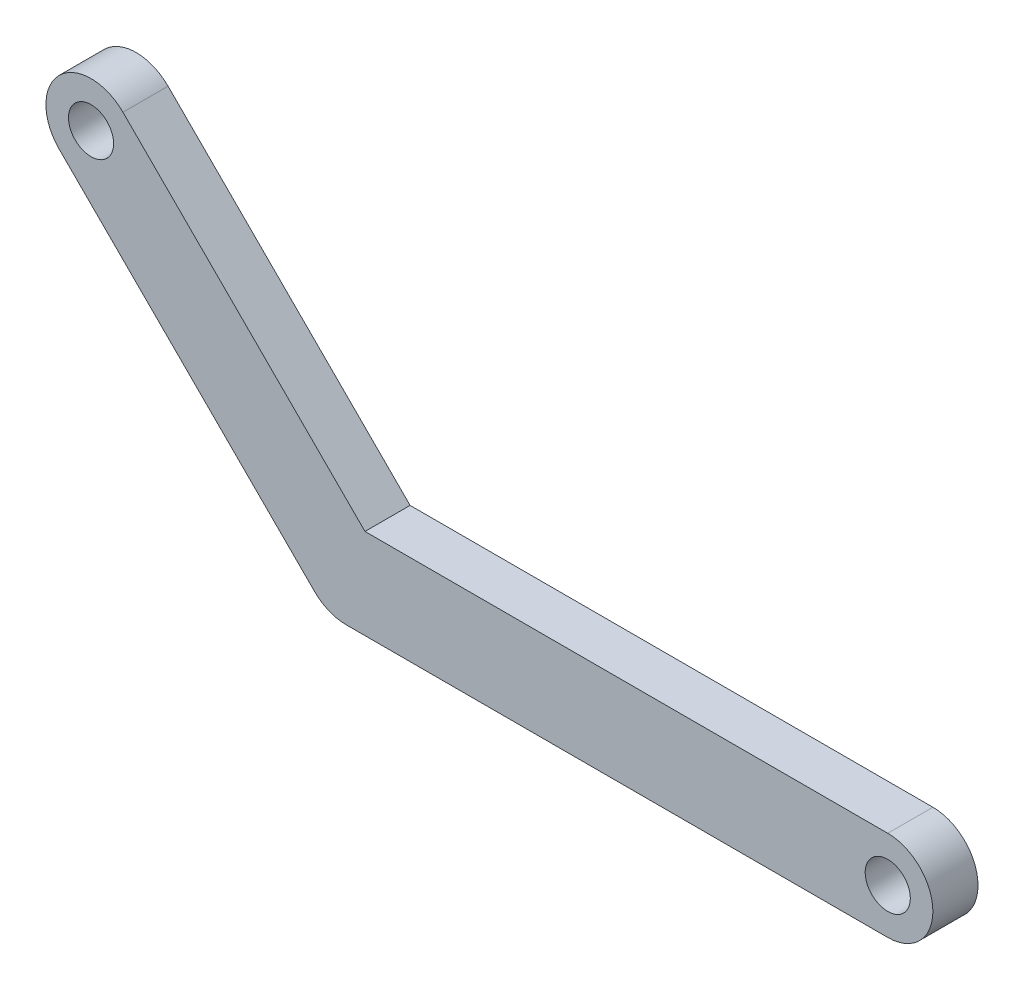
ISO-10303-21;
HEADER;
FILE_DESCRIPTION(('STEP AP214'),'2;1');
FILE_NAME('part.step','',(''),(''),'','','');
FILE_SCHEMA(('AUTOMOTIVE_DESIGN { 1 0 10303 214 1 1 1 1 }'));
ENDSEC;
DATA;
#1=APPLICATION_CONTEXT('core data for automotive mechanical design processes');
#2=APPLICATION_PROTOCOL_DEFINITION('international standard','automotive_design',2000,#1);
#3=PRODUCT_CONTEXT('',#1,'mechanical');
#4=PRODUCT('Part','Part','',(#3));
#5=PRODUCT_RELATED_PRODUCT_CATEGORY('part','',(#4));
#6=PRODUCT_DEFINITION_FORMATION('','',#4);
#7=PRODUCT_DEFINITION_CONTEXT('part definition',#1,'design');
#8=PRODUCT_DEFINITION('design','',#6,#7);
#9=PRODUCT_DEFINITION_SHAPE('','',#8);
#10=(LENGTH_UNIT() NAMED_UNIT(*) SI_UNIT(.MILLI.,.METRE.));
#11=(NAMED_UNIT(*) PLANE_ANGLE_UNIT() SI_UNIT($,.RADIAN.));
#12=(NAMED_UNIT(*) SI_UNIT($,.STERADIAN.) SOLID_ANGLE_UNIT());
#13=UNCERTAINTY_MEASURE_WITH_UNIT(LENGTH_MEASURE(1.E-05),#10,'distance_accuracy_value','');
#14=(GEOMETRIC_REPRESENTATION_CONTEXT(3) GLOBAL_UNCERTAINTY_ASSIGNED_CONTEXT((#13)) GLOBAL_UNIT_ASSIGNED_CONTEXT((#10,
#11,#12)) REPRESENTATION_CONTEXT('',''));
#15=CARTESIAN_POINT('',(0.,0.,0.));
#16=DIRECTION('',(0.,0.,1.));
#17=DIRECTION('',(1.,0.,0.));
#18=AXIS2_PLACEMENT_3D('',#15,#16,#17);
#19=CARTESIAN_POINT('',(0.,3.175,3.175));
#20=DIRECTION('',(0.,-1.,0.));
#21=DIRECTION('',(0.,0.,-1.));
#22=AXIS2_PLACEMENT_3D('',#19,#20,#21);
#23=PLANE('',#22);
#24=DIRECTION('',(0.,0.,-1.));
#25=VECTOR('',#24,1.);
#26=CARTESIAN_POINT('',(1.31512806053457,3.175,3.175));
#27=LINE('',#26,#25);
#28=CARTESIAN_POINT('',(1.31512806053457,3.175,3.175));
#29=VERTEX_POINT('',#28);
#30=CARTESIAN_POINT('',(1.31512806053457,3.175,0.));
#31=VERTEX_POINT('',#30);
#32=EDGE_CURVE('E11',#29,#31,#27,.T.);
#33=ORIENTED_EDGE('',*,*,#32,.F.);
#34=DIRECTION('',(-1.,0.,0.));
#35=VECTOR('',#34,1.);
#36=CARTESIAN_POINT('',(0.,3.175,3.175));
#37=LINE('',#36,#35);
#38=CARTESIAN_POINT('',(38.1,3.175,3.175));
#39=VERTEX_POINT('',#38);
#40=EDGE_CURVE('E98',#39,#29,#37,.T.);
#41=ORIENTED_EDGE('',*,*,#40,.F.);
#42=DIRECTION('',(0.,0.,-1.));
#43=VECTOR('',#42,1.);
#44=CARTESIAN_POINT('',(38.1,3.175,3.175));
#45=LINE('',#44,#43);
#46=CARTESIAN_POINT('',(38.1,3.175,0.));
#47=VERTEX_POINT('',#46);
#48=EDGE_CURVE('E141',#39,#47,#45,.T.);
#49=ORIENTED_EDGE('',*,*,#48,.T.);
#50=DIRECTION('',(-1.,0.,0.));
#51=VECTOR('',#50,1.);
#52=CARTESIAN_POINT('',(0.,3.175,0.));
#53=LINE('',#52,#51);
#54=EDGE_CURVE('E136',#47,#31,#53,.T.);
#55=ORIENTED_EDGE('',*,*,#54,.T.);
#56=EDGE_LOOP('',(#33,#41,#49,#55));
#57=FACE_BOUND('',#56,.T.);
#58=ADVANCED_FACE('F32',(#57),#23,.F.);
#59=CARTESIAN_POINT('',(0.,0.,3.175));
#60=DIRECTION('',(0.,0.,1.));
#61=DIRECTION('',(1.,0.,0.));
#62=AXIS2_PLACEMENT_3D('',#59,#60,#61);
#63=PLANE('',#62);
#64=CARTESIAN_POINT('',(0.,0.,3.175));
#65=DIRECTION('',(0.,0.,1.));
#66=DIRECTION('',(1.,0.,0.));
#67=AXIS2_PLACEMENT_3D('',#64,#65,#66);
#68=CIRCLE('',#67,3.175);
#69=CARTESIAN_POINT('',(-2.24506403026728,-2.2450640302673,3.175));
#70=VERTEX_POINT('',#69);
#71=CARTESIAN_POINT('',(0.,-3.175,3.175));
#72=VERTEX_POINT('',#71);
#73=EDGE_CURVE('E47',#70,#72,#68,.T.);
#74=ORIENTED_EDGE('',*,*,#73,.T.);
#75=DIRECTION('',(1.,0.,0.));
#76=VECTOR('',#75,1.);
#77=CARTESIAN_POINT('',(0.,-3.175,3.175));
#78=LINE('',#77,#76);
#79=CARTESIAN_POINT('',(38.1,-3.175,3.175));
#80=VERTEX_POINT('',#79);
#81=EDGE_CURVE('E135',#72,#80,#78,.T.);
#82=ORIENTED_EDGE('',*,*,#81,.T.);
#83=CARTESIAN_POINT('',(38.1,0.,3.175));
#84=DIRECTION('',(0.,0.,1.));
#85=DIRECTION('',(1.,0.,0.));
#86=AXIS2_PLACEMENT_3D('',#83,#84,#85);
#87=CIRCLE('',#86,3.175);
#88=EDGE_CURVE('E138',#80,#39,#87,.T.);
#89=ORIENTED_EDGE('',*,*,#88,.T.);
#90=ORIENTED_EDGE('',*,*,#40,.T.);
#91=DIRECTION('',(-0.707106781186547,0.707106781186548,0.));
#92=VECTOR('',#91,1.);
#93=CARTESIAN_POINT('',(2.24506403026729,2.24506403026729,3.175));
#94=LINE('',#93,#92);
#95=CARTESIAN_POINT('',(-15.7154482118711,20.2055762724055,3.175));
#96=VERTEX_POINT('',#95);
#97=EDGE_CURVE('E90',#29,#96,#94,.T.);
#98=ORIENTED_EDGE('',*,*,#97,.T.);
#99=CARTESIAN_POINT('',(-17.9605122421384,17.9605122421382,3.175));
#100=DIRECTION('',(0.,0.,1.));
#101=DIRECTION('',(1.,0.,0.));
#102=AXIS2_PLACEMENT_3D('',#99,#100,#101);
#103=CIRCLE('',#102,3.17500000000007);
#104=CARTESIAN_POINT('',(-20.2055762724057,15.7154482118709,3.175));
#105=VERTEX_POINT('',#104);
#106=EDGE_CURVE('E95',#96,#105,#103,.T.);
#107=ORIENTED_EDGE('',*,*,#106,.T.);
#108=DIRECTION('',(0.707106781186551,-0.707106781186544,0.));
#109=VECTOR('',#108,1.);
#110=CARTESIAN_POINT('',(-2.24506403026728,-2.2450640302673,3.175));
#111=LINE('',#110,#109);
#112=EDGE_CURVE('E115',#105,#70,#111,.T.);
#113=ORIENTED_EDGE('',*,*,#112,.T.);
#114=EDGE_LOOP('',(#74,#82,#89,#90,#98,#107,#113));
#115=FACE_BOUND('',#114,.T.);
#116=CARTESIAN_POINT('',(-17.9605122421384,17.9605122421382,3.175));
#117=DIRECTION('',(0.,0.,1.));
#118=DIRECTION('',(1.,0.,0.));
#119=AXIS2_PLACEMENT_3D('',#116,#117,#118);
#120=CIRCLE('',#119,1.5875);
#121=CARTESIAN_POINT('',(-16.3730122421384,17.9605122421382,3.175));
#122=VERTEX_POINT('',#121);
#123=EDGE_CURVE('E122',#122,#122,#120,.T.);
#124=ORIENTED_EDGE('',*,*,#123,.F.);
#125=EDGE_LOOP('',(#124));
#126=FACE_BOUND('',#125,.T.);
#127=CARTESIAN_POINT('',(38.1,0.,3.175));
#128=DIRECTION('',(0.,0.,1.));
#129=DIRECTION('',(1.,0.,0.));
#130=AXIS2_PLACEMENT_3D('',#127,#128,#129);
#131=CIRCLE('',#130,1.5875);
#132=CARTESIAN_POINT('',(39.6875,0.,3.175));
#133=VERTEX_POINT('',#132);
#134=EDGE_CURVE('E128',#133,#133,#131,.T.);
#135=ORIENTED_EDGE('',*,*,#134,.F.);
#136=EDGE_LOOP('',(#135));
#137=FACE_BOUND('',#136,.T.);
#138=ADVANCED_FACE('F92',(#115,#126,#137),#63,.T.);
#139=CARTESIAN_POINT('',(0.,0.,0.));
#140=DIRECTION('',(0.,0.,1.));
#141=DIRECTION('',(1.,0.,0.));
#142=AXIS2_PLACEMENT_3D('',#139,#140,#141);
#143=PLANE('',#142);
#144=DIRECTION('',(1.,0.,0.));
#145=VECTOR('',#144,1.);
#146=CARTESIAN_POINT('',(0.,-3.175,0.));
#147=LINE('',#146,#145);
#148=CARTESIAN_POINT('',(0.,-3.175,0.));
#149=VERTEX_POINT('',#148);
#150=CARTESIAN_POINT('',(38.1,-3.175,0.));
#151=VERTEX_POINT('',#150);
#152=EDGE_CURVE('E143',#149,#151,#147,.T.);
#153=ORIENTED_EDGE('',*,*,#152,.F.);
#154=CARTESIAN_POINT('',(0.,0.,0.));
#155=DIRECTION('',(0.,0.,1.));
#156=DIRECTION('',(1.,0.,0.));
#157=AXIS2_PLACEMENT_3D('',#154,#155,#156);
#158=CIRCLE('',#157,3.175);
#159=CARTESIAN_POINT('',(-2.24506403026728,-2.2450640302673,0.));
#160=VERTEX_POINT('',#159);
#161=EDGE_CURVE('E131',#160,#149,#158,.T.);
#162=ORIENTED_EDGE('',*,*,#161,.F.);
#163=DIRECTION('',(0.707106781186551,-0.707106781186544,0.));
#164=VECTOR('',#163,1.);
#165=CARTESIAN_POINT('',(-2.24506403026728,-2.2450640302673,0.));
#166=LINE('',#165,#164);
#167=CARTESIAN_POINT('',(-20.2055762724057,15.7154482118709,0.));
#168=VERTEX_POINT('',#167);
#169=EDGE_CURVE('E100',#168,#160,#166,.T.);
#170=ORIENTED_EDGE('',*,*,#169,.F.);
#171=CARTESIAN_POINT('',(-17.9605122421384,17.9605122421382,0.));
#172=DIRECTION('',(0.,0.,1.));
#173=DIRECTION('',(1.,0.,0.));
#174=AXIS2_PLACEMENT_3D('',#171,#172,#173);
#175=CIRCLE('',#174,3.17500000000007);
#176=CARTESIAN_POINT('',(-15.7154482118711,20.2055762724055,0.));
#177=VERTEX_POINT('',#176);
#178=EDGE_CURVE('E121',#177,#168,#175,.T.);
#179=ORIENTED_EDGE('',*,*,#178,.F.);
#180=DIRECTION('',(-0.707106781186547,0.707106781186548,0.));
#181=VECTOR('',#180,1.);
#182=CARTESIAN_POINT('',(2.24506403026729,2.24506403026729,0.));
#183=LINE('',#182,#181);
#184=EDGE_CURVE('E106',#31,#177,#183,.T.);
#185=ORIENTED_EDGE('',*,*,#184,.F.);
#186=ORIENTED_EDGE('',*,*,#54,.F.);
#187=CARTESIAN_POINT('',(38.1,0.,0.));
#188=DIRECTION('',(0.,0.,1.));
#189=DIRECTION('',(1.,0.,0.));
#190=AXIS2_PLACEMENT_3D('',#187,#188,#189);
#191=CIRCLE('',#190,3.175);
#192=EDGE_CURVE('E145',#151,#47,#191,.T.);
#193=ORIENTED_EDGE('',*,*,#192,.F.);
#194=EDGE_LOOP('',(#153,#162,#170,#179,#185,#186,#193));
#195=FACE_BOUND('',#194,.T.);
#196=CARTESIAN_POINT('',(-17.9605122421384,17.9605122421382,0.));
#197=DIRECTION('',(0.,0.,1.));
#198=DIRECTION('',(1.,0.,0.));
#199=AXIS2_PLACEMENT_3D('',#196,#197,#198);
#200=CIRCLE('',#199,1.5875);
#201=CARTESIAN_POINT('',(-16.3730122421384,17.9605122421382,0.));
#202=VERTEX_POINT('',#201);
#203=EDGE_CURVE('E277',#202,#202,#200,.T.);
#204=ORIENTED_EDGE('',*,*,#203,.T.);
#205=EDGE_LOOP('',(#204));
#206=FACE_BOUND('',#205,.T.);
#207=CARTESIAN_POINT('',(38.1,0.,0.));
#208=DIRECTION('',(0.,0.,1.));
#209=DIRECTION('',(1.,0.,0.));
#210=AXIS2_PLACEMENT_3D('',#207,#208,#209);
#211=CIRCLE('',#210,1.5875);
#212=CARTESIAN_POINT('',(39.6875,0.,0.));
#213=VERTEX_POINT('',#212);
#214=EDGE_CURVE('E109',#213,#213,#211,.T.);
#215=ORIENTED_EDGE('',*,*,#214,.T.);
#216=EDGE_LOOP('',(#215));
#217=FACE_BOUND('',#216,.T.);
#218=ADVANCED_FACE('F161',(#195,#206,#217),#143,.F.);
#219=CARTESIAN_POINT('',(0.,0.,3.175));
#220=DIRECTION('',(0.,0.,-1.));
#221=DIRECTION('',(-1.,0.,0.));
#222=AXIS2_PLACEMENT_3D('',#219,#220,#221);
#223=CYLINDRICAL_SURFACE('',#222,3.175);
#224=ORIENTED_EDGE('',*,*,#73,.F.);
#225=DIRECTION('',(0.,0.,-1.));
#226=VECTOR('',#225,1.);
#227=CARTESIAN_POINT('',(-2.24506403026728,-2.2450640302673,3.175));
#228=LINE('',#227,#226);
#229=EDGE_CURVE('E52',#70,#160,#228,.T.);
#230=ORIENTED_EDGE('',*,*,#229,.T.);
#231=ORIENTED_EDGE('',*,*,#161,.T.);
#232=DIRECTION('',(0.,0.,-1.));
#233=VECTOR('',#232,1.);
#234=CARTESIAN_POINT('',(0.,-3.175,3.175));
#235=LINE('',#234,#233);
#236=EDGE_CURVE('E40',#72,#149,#235,.T.);
#237=ORIENTED_EDGE('',*,*,#236,.F.);
#238=EDGE_LOOP('',(#224,#230,#231,#237));
#239=FACE_BOUND('',#238,.T.);
#240=ADVANCED_FACE('F34',(#239),#223,.T.);
#241=CARTESIAN_POINT('',(0.,-3.175,3.175));
#242=DIRECTION('',(0.,1.,0.));
#243=DIRECTION('',(0.,0.,1.));
#244=AXIS2_PLACEMENT_3D('',#241,#242,#243);
#245=PLANE('',#244);
#246=ORIENTED_EDGE('',*,*,#152,.T.);
#247=DIRECTION('',(0.,0.,-1.));
#248=VECTOR('',#247,1.);
#249=CARTESIAN_POINT('',(38.1,-3.175,3.175));
#250=LINE('',#249,#248);
#251=EDGE_CURVE('E150',#80,#151,#250,.T.);
#252=ORIENTED_EDGE('',*,*,#251,.F.);
#253=ORIENTED_EDGE('',*,*,#81,.F.);
#254=ORIENTED_EDGE('',*,*,#236,.T.);
#255=EDGE_LOOP('',(#246,#252,#253,#254));
#256=FACE_BOUND('',#255,.T.);
#257=ADVANCED_FACE('F155',(#256),#245,.F.);
#258=CARTESIAN_POINT('',(38.1,0.,3.175));
#259=DIRECTION('',(0.,0.,-1.));
#260=DIRECTION('',(-1.,0.,0.));
#261=AXIS2_PLACEMENT_3D('',#258,#259,#260);
#262=CYLINDRICAL_SURFACE('',#261,3.175);
#263=ORIENTED_EDGE('',*,*,#192,.T.);
#264=ORIENTED_EDGE('',*,*,#48,.F.);
#265=ORIENTED_EDGE('',*,*,#88,.F.);
#266=ORIENTED_EDGE('',*,*,#251,.T.);
#267=EDGE_LOOP('',(#263,#264,#265,#266));
#268=FACE_BOUND('',#267,.T.);
#269=ADVANCED_FACE('F166',(#268),#262,.T.);
#270=CARTESIAN_POINT('',(38.1,0.,3.175));
#271=DIRECTION('',(0.,0.,-1.));
#272=DIRECTION('',(-1.,0.,0.));
#273=AXIS2_PLACEMENT_3D('',#270,#271,#272);
#274=CYLINDRICAL_SURFACE('',#273,1.5875);
#275=ORIENTED_EDGE('',*,*,#134,.T.);
#276=EDGE_LOOP('',(#275));
#277=FACE_BOUND('',#276,.T.);
#278=ORIENTED_EDGE('',*,*,#214,.F.);
#279=EDGE_LOOP('',(#278));
#280=FACE_BOUND('',#279,.T.);
#281=ADVANCED_FACE('F190',(#277,#280),#274,.F.);
#282=CARTESIAN_POINT('',(2.24506403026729,2.24506403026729,3.175));
#283=DIRECTION('',(-0.707106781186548,-0.707106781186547,0.));
#284=DIRECTION('',(0.707106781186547,-0.707106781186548,0.));
#285=AXIS2_PLACEMENT_3D('',#282,#283,#284);
#286=PLANE('',#285);
#287=ORIENTED_EDGE('',*,*,#97,.F.);
#288=ORIENTED_EDGE('',*,*,#32,.T.);
#289=ORIENTED_EDGE('',*,*,#184,.T.);
#290=DIRECTION('',(0.,0.,-1.));
#291=VECTOR('',#290,1.);
#292=CARTESIAN_POINT('',(-15.7154482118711,20.2055762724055,3.175));
#293=LINE('',#292,#291);
#294=EDGE_CURVE('E103',#96,#177,#293,.T.);
#295=ORIENTED_EDGE('',*,*,#294,.F.);
#296=EDGE_LOOP('',(#287,#288,#289,#295));
#297=FACE_BOUND('',#296,.T.);
#298=ADVANCED_FACE('F104',(#297),#286,.F.);
#299=CARTESIAN_POINT('',(-17.9605122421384,17.9605122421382,3.175));
#300=DIRECTION('',(0.,0.,-1.));
#301=DIRECTION('',(-1.,0.,0.));
#302=AXIS2_PLACEMENT_3D('',#299,#300,#301);
#303=CYLINDRICAL_SURFACE('',#302,3.17500000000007);
#304=ORIENTED_EDGE('',*,*,#178,.T.);
#305=DIRECTION('',(0.,0.,-1.));
#306=VECTOR('',#305,1.);
#307=CARTESIAN_POINT('',(-20.2055762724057,15.7154482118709,3.175));
#308=LINE('',#307,#306);
#309=EDGE_CURVE('E110',#105,#168,#308,.T.);
#310=ORIENTED_EDGE('',*,*,#309,.F.);
#311=ORIENTED_EDGE('',*,*,#106,.F.);
#312=ORIENTED_EDGE('',*,*,#294,.T.);
#313=EDGE_LOOP('',(#304,#310,#311,#312));
#314=FACE_BOUND('',#313,.T.);
#315=ADVANCED_FACE('F112',(#314),#303,.T.);
#316=CARTESIAN_POINT('',(-2.24506403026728,-2.2450640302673,3.175));
#317=DIRECTION('',(0.707106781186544,0.707106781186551,0.));
#318=DIRECTION('',(-0.707106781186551,0.707106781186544,0.));
#319=AXIS2_PLACEMENT_3D('',#316,#317,#318);
#320=PLANE('',#319);
#321=ORIENTED_EDGE('',*,*,#169,.T.);
#322=ORIENTED_EDGE('',*,*,#229,.F.);
#323=ORIENTED_EDGE('',*,*,#112,.F.);
#324=ORIENTED_EDGE('',*,*,#309,.T.);
#325=EDGE_LOOP('',(#321,#322,#323,#324));
#326=FACE_BOUND('',#325,.T.);
#327=ADVANCED_FACE('F170',(#326),#320,.F.);
#328=CARTESIAN_POINT('',(-17.9605122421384,17.9605122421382,3.175));
#329=DIRECTION('',(0.,0.,-1.));
#330=DIRECTION('',(-1.,0.,0.));
#331=AXIS2_PLACEMENT_3D('',#328,#329,#330);
#332=CYLINDRICAL_SURFACE('',#331,1.5875);
#333=ORIENTED_EDGE('',*,*,#123,.T.);
#334=EDGE_LOOP('',(#333));
#335=FACE_BOUND('',#334,.T.);
#336=ORIENTED_EDGE('',*,*,#203,.F.);
#337=EDGE_LOOP('',(#336));
#338=FACE_BOUND('',#337,.T.);
#339=ADVANCED_FACE('F172',(#335,#338),#332,.F.);
#340=CLOSED_SHELL('',(#58,#138,#218,#240,#257,#269,#281,#298,#315,#327,#339));
#341=MANIFOLD_SOLID_BREP('B2',#340);
#342=ADVANCED_BREP_SHAPE_REPRESENTATION('',(#18,#341),#14);
#343=SHAPE_DEFINITION_REPRESENTATION(#9,#342);
ENDSEC;
END-ISO-10303-21;
